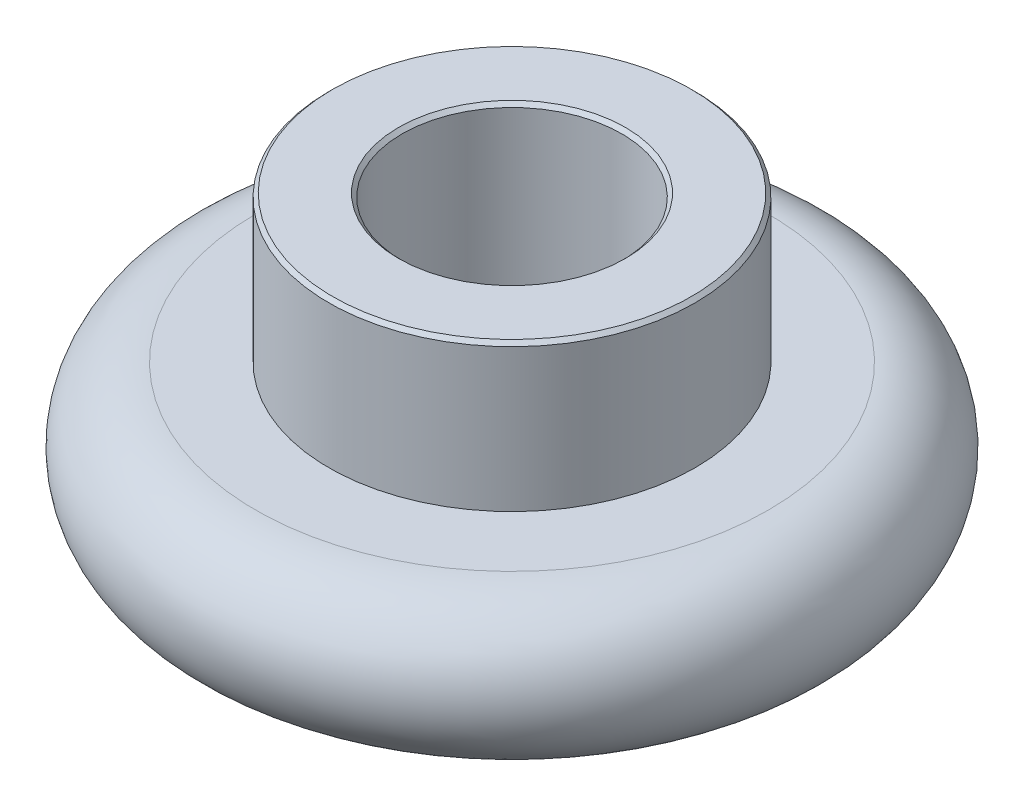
from build123d import *

# Parameters (mm, degrees)
CHAMFER_1_SIZE = 0.5


with BuildPart() as part:
    # Sketch 1 → Revolve 1 (revolve)
    with BuildSketch(Plane.XY):
        with BuildLine():
            Line((0, 10), (0, 0))
            Line((0, 0), (-35, 0))
            ThreePointArc((-35, 0), (-45, 10), (-35, 20))
            Line((-35, 20), (-25, 20))
            Line((-25, 20), (-25, 40))
            Line((-25, 40), (-15, 40))
            Line((-15, 40), (-15, 10))
            Line((-15, 10), (0, 10))
        make_face()
    revolve(axis=Axis((0, 10, 0), (0, -1, 0)))

    # Chamfer 1
    chamfer_1_edges = [part.edges().sort_by_distance(p)[0] for p in [
        (25, 40, 0),
        (15, 40, 0),
        (15, 10, 0),
    ]]
    chamfer(chamfer_1_edges, length=CHAMFER_1_SIZE)


solid = part.part
